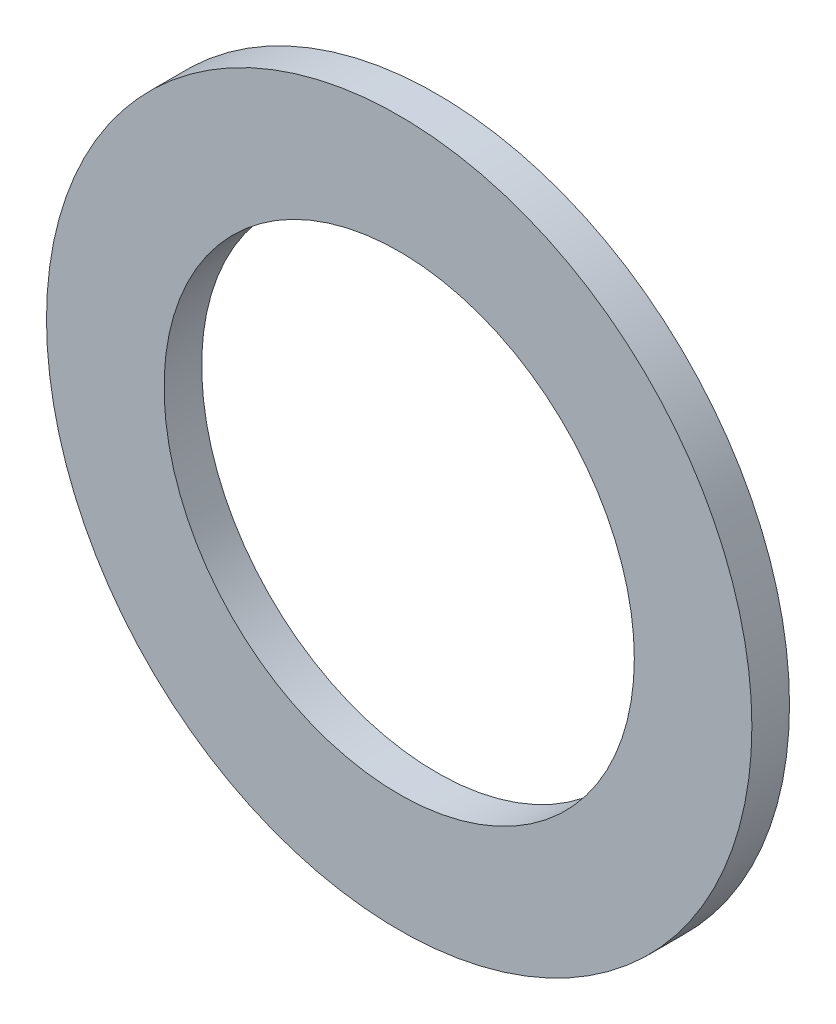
from build123d import *

# Parameters (mm, degrees)
SKETCH1_R           = 2.38125
SKETCH1_R_2         = 1.5875
BOSS_EXTRUDE1_DEPTH = 0.254


with BuildPart() as part:
    # Sketch1 → Boss-Extrude1 (new body)
    with BuildSketch(Plane.XY):
        Circle(SKETCH1_R)
        Circle(SKETCH1_R_2, mode=Mode.SUBTRACT)
    extrude(amount=BOSS_EXTRUDE1_DEPTH)


solid = part.part
